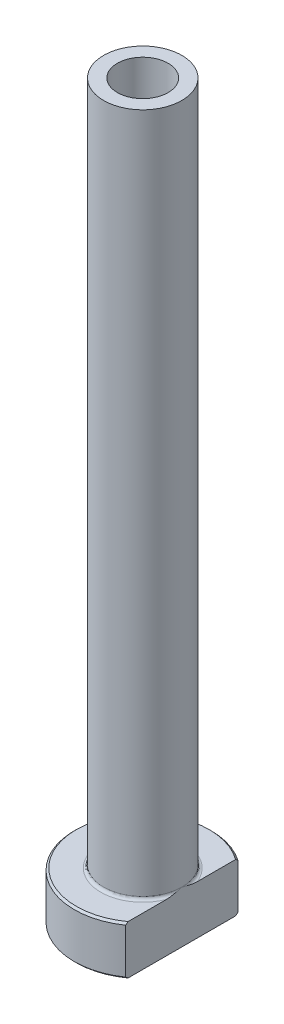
ISO-10303-21;
HEADER;
FILE_DESCRIPTION(('STEP AP214'),'2;1');
FILE_NAME('part.step','',(''),(''),'','','');
FILE_SCHEMA(('AUTOMOTIVE_DESIGN { 1 0 10303 214 1 1 1 1 }'));
ENDSEC;
DATA;
#1=APPLICATION_CONTEXT('core data for automotive mechanical design processes');
#2=APPLICATION_PROTOCOL_DEFINITION('international standard','automotive_design',2000,#1);
#3=PRODUCT_CONTEXT('',#1,'mechanical');
#4=PRODUCT('Part','Part','',(#3));
#5=PRODUCT_RELATED_PRODUCT_CATEGORY('part','',(#4));
#6=PRODUCT_DEFINITION_FORMATION('','',#4);
#7=PRODUCT_DEFINITION_CONTEXT('part definition',#1,'design');
#8=PRODUCT_DEFINITION('design','',#6,#7);
#9=PRODUCT_DEFINITION_SHAPE('','',#8);
#10=(LENGTH_UNIT() NAMED_UNIT(*) SI_UNIT(.MILLI.,.METRE.));
#11=(NAMED_UNIT(*) PLANE_ANGLE_UNIT() SI_UNIT($,.RADIAN.));
#12=(NAMED_UNIT(*) SI_UNIT($,.STERADIAN.) SOLID_ANGLE_UNIT());
#13=UNCERTAINTY_MEASURE_WITH_UNIT(LENGTH_MEASURE(1.E-05),#10,'distance_accuracy_value','');
#14=(GEOMETRIC_REPRESENTATION_CONTEXT(3) GLOBAL_UNCERTAINTY_ASSIGNED_CONTEXT((#13)) GLOBAL_UNIT_ASSIGNED_CONTEXT((#10,
#11,#12)) REPRESENTATION_CONTEXT('',''));
#15=CARTESIAN_POINT('',(0.,0.,0.));
#16=DIRECTION('',(0.,0.,1.));
#17=DIRECTION('',(1.,0.,0.));
#18=AXIS2_PLACEMENT_3D('',#15,#16,#17);
#19=CARTESIAN_POINT('',(0.,92.1876809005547,0.));
#20=DIRECTION('',(0.,1.,0.));
#21=DIRECTION('',(0.,0.,1.));
#22=AXIS2_PLACEMENT_3D('',#19,#20,#21);
#23=CYLINDRICAL_SURFACE('',#22,2.60000000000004);
#24=CARTESIAN_POINT('',(0.,75.,0.));
#25=DIRECTION('',(0.,1.,0.));
#26=DIRECTION('',(0.,0.,1.));
#27=AXIS2_PLACEMENT_3D('',#24,#25,#26);
#28=CIRCLE('',#27,2.60000000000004);
#29=CARTESIAN_POINT('',(0.,75.,2.60000000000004));
#30=VERTEX_POINT('',#29);
#31=EDGE_CURVE('E167',#30,#30,#28,.T.);
#32=ORIENTED_EDGE('',*,*,#31,.T.);
#33=EDGE_LOOP('',(#32));
#34=FACE_BOUND('',#33,.T.);
#35=CARTESIAN_POINT('',(0.,30.,0.));
#36=DIRECTION('',(0.,1.,0.));
#37=DIRECTION('',(0.,0.,1.));
#38=AXIS2_PLACEMENT_3D('',#35,#36,#37);
#39=CIRCLE('',#38,2.60000000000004);
#40=CARTESIAN_POINT('',(0.,30.,2.60000000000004));
#41=VERTEX_POINT('',#40);
#42=EDGE_CURVE('E170',#41,#41,#39,.T.);
#43=ORIENTED_EDGE('',*,*,#42,.F.);
#44=EDGE_LOOP('',(#43));
#45=FACE_BOUND('',#44,.T.);
#46=ADVANCED_FACE('F32',(#34,#45),#23,.F.);
#47=CARTESIAN_POINT('',(-2.60000000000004,75.,0.));
#48=DIRECTION('',(0.,1.,0.));
#49=DIRECTION('',(0.,0.,1.));
#50=AXIS2_PLACEMENT_3D('',#47,#48,#49);
#51=PLANE('',#50);
#52=CARTESIAN_POINT('',(0.,75.,0.));
#53=DIRECTION('',(0.,1.,0.));
#54=DIRECTION('',(0.,0.,1.));
#55=AXIS2_PLACEMENT_3D('',#52,#53,#54);
#56=CIRCLE('',#55,4.);
#57=CARTESIAN_POINT('',(0.,75.,4.));
#58=VERTEX_POINT('',#57);
#59=EDGE_CURVE('E174',#58,#58,#56,.T.);
#60=ORIENTED_EDGE('',*,*,#59,.T.);
#61=EDGE_LOOP('',(#60));
#62=FACE_BOUND('',#61,.T.);
#63=ORIENTED_EDGE('',*,*,#31,.F.);
#64=EDGE_LOOP('',(#63));
#65=FACE_BOUND('',#64,.T.);
#66=ADVANCED_FACE('F157',(#62,#65),#51,.T.);
#67=CARTESIAN_POINT('',(0.,92.1876809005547,0.));
#68=DIRECTION('',(0.,1.,0.));
#69=DIRECTION('',(0.,0.,1.));
#70=AXIS2_PLACEMENT_3D('',#67,#68,#69);
#71=CYLINDRICAL_SURFACE('',#70,3.99999999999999);
#72=CARTESIAN_POINT('',(0.,5.3,0.));
#73=DIRECTION('',(0.,1.,0.));
#74=DIRECTION('',(0.,0.,1.));
#75=AXIS2_PLACEMENT_3D('',#72,#73,#74);
#76=CIRCLE('',#75,3.99999999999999);
#77=CARTESIAN_POINT('',(3.99999999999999,5.3,0.));
#78=VERTEX_POINT('',#77);
#79=EDGE_CURVE('E180',#78,#78,#76,.T.);
#80=ORIENTED_EDGE('',*,*,#79,.T.);
#81=EDGE_LOOP('',(#80));
#82=FACE_BOUND('',#81,.T.);
#83=ORIENTED_EDGE('',*,*,#59,.F.);
#84=EDGE_LOOP('',(#83));
#85=FACE_BOUND('',#84,.T.);
#86=ADVANCED_FACE('F162',(#82,#85),#71,.T.);
#87=CARTESIAN_POINT('',(-3.99999999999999,5.,0.));
#88=DIRECTION('',(0.,1.,0.));
#89=DIRECTION('',(0.,0.,1.));
#90=AXIS2_PLACEMENT_3D('',#87,#88,#89);
#91=PLANE('',#90);
#92=DIRECTION('',(0.,0.,1.));
#93=VECTOR('',#92,1.);
#94=CARTESIAN_POINT('',(4.,5.,0.));
#95=LINE('',#94,#93);
#96=CARTESIAN_POINT('',(4.,5.,-5.49909083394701));
#97=VERTEX_POINT('',#96);
#98=CARTESIAN_POINT('',(4.,5.,-1.57797338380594));
#99=VERTEX_POINT('',#98);
#100=EDGE_CURVE('E54',#97,#99,#95,.T.);
#101=ORIENTED_EDGE('',*,*,#100,.F.);
#102=CARTESIAN_POINT('',(0.,5.,0.));
#103=DIRECTION('',(0.,1.,0.));
#104=DIRECTION('',(0.,0.,1.));
#105=AXIS2_PLACEMENT_3D('',#102,#103,#104);
#106=CIRCLE('',#105,6.8);
#107=CARTESIAN_POINT('',(3.99999999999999,5.,5.49909083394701));
#108=VERTEX_POINT('',#107);
#109=EDGE_CURVE('E186',#97,#108,#106,.T.);
#110=ORIENTED_EDGE('',*,*,#109,.T.);
#111=CARTESIAN_POINT('',(4.,5.,1.57797338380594));
#112=VERTEX_POINT('',#111);
#113=EDGE_CURVE('E134',#112,#108,#95,.T.);
#114=ORIENTED_EDGE('',*,*,#113,.F.);
#115=CARTESIAN_POINT('',(0.,5.,0.));
#116=DIRECTION('',(0.,1.,0.));
#117=DIRECTION('',(0.,0.,1.));
#118=AXIS2_PLACEMENT_3D('',#115,#116,#117);
#119=CIRCLE('',#118,4.29999999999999);
#120=EDGE_CURVE('E183',#112,#99,#119,.F.);
#121=ORIENTED_EDGE('',*,*,#120,.T.);
#122=EDGE_LOOP('',(#101,#110,#114,#121));
#123=FACE_BOUND('',#122,.T.);
#124=ADVANCED_FACE('F197',(#123),#91,.T.);
#125=CARTESIAN_POINT('',(0.,92.1876809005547,0.));
#126=DIRECTION('',(0.,1.,0.));
#127=DIRECTION('',(0.,0.,1.));
#128=AXIS2_PLACEMENT_3D('',#125,#126,#127);
#129=CYLINDRICAL_SURFACE('',#128,6.99999999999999);
#130=DIRECTION('',(0.,-1.,0.));
#131=VECTOR('',#130,1.);
#132=CARTESIAN_POINT('',(3.99999999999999,75.,5.74456264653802));
#133=LINE('',#132,#131);
#134=CARTESIAN_POINT('',(3.99999999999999,4.8,5.74456264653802));
#135=VERTEX_POINT('',#134);
#136=CARTESIAN_POINT('',(3.99999999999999,0.199999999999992,5.74456264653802));
#137=VERTEX_POINT('',#136);
#138=EDGE_CURVE('E82',#135,#137,#133,.T.);
#139=ORIENTED_EDGE('',*,*,#138,.F.);
#140=CARTESIAN_POINT('',(0.,4.8,0.));
#141=DIRECTION('',(0.,1.,0.));
#142=DIRECTION('',(0.,0.,1.));
#143=AXIS2_PLACEMENT_3D('',#140,#141,#142);
#144=CIRCLE('',#143,6.99999999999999);
#145=CARTESIAN_POINT('',(4.,4.8,-5.74456264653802));
#146=VERTEX_POINT('',#145);
#147=EDGE_CURVE('E95',#135,#146,#144,.F.);
#148=ORIENTED_EDGE('',*,*,#147,.T.);
#149=DIRECTION('',(0.,-1.,0.));
#150=VECTOR('',#149,1.);
#151=CARTESIAN_POINT('',(4.,75.,-5.74456264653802));
#152=LINE('',#151,#150);
#153=CARTESIAN_POINT('',(4.,0.199999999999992,-5.74456264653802));
#154=VERTEX_POINT('',#153);
#155=EDGE_CURVE('E192',#146,#154,#152,.T.);
#156=ORIENTED_EDGE('',*,*,#155,.T.);
#157=CARTESIAN_POINT('',(0.,0.199999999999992,0.));
#158=DIRECTION('',(0.,-1.,0.));
#159=DIRECTION('',(0.,0.,-1.));
#160=AXIS2_PLACEMENT_3D('',#157,#158,#159);
#161=CIRCLE('',#160,6.99999999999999);
#162=EDGE_CURVE('E98',#154,#137,#161,.F.);
#163=ORIENTED_EDGE('',*,*,#162,.T.);
#164=EDGE_LOOP('',(#139,#148,#156,#163));
#165=FACE_BOUND('',#164,.T.);
#166=ADVANCED_FACE('F190',(#165),#129,.T.);
#167=CARTESIAN_POINT('',(-6.99999999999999,0.,0.));
#168=DIRECTION('',(0.,-1.,0.));
#169=DIRECTION('',(0.,0.,-1.));
#170=AXIS2_PLACEMENT_3D('',#167,#168,#169);
#171=PLANE('',#170);
#172=CARTESIAN_POINT('',(0.,0.,0.));
#173=DIRECTION('',(0.,-1.,0.));
#174=DIRECTION('',(0.,0.,-1.));
#175=AXIS2_PLACEMENT_3D('',#172,#173,#174);
#176=CIRCLE('',#175,3.34999999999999);
#177=CARTESIAN_POINT('',(0.,0.,-3.34999999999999));
#178=VERTEX_POINT('',#177);
#179=EDGE_CURVE('E40',#178,#178,#176,.F.);
#180=ORIENTED_EDGE('',*,*,#179,.T.);
#181=EDGE_LOOP('',(#180));
#182=FACE_BOUND('',#181,.T.);
#183=DIRECTION('',(0.,0.,-1.));
#184=VECTOR('',#183,1.);
#185=CARTESIAN_POINT('',(3.99999999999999,0.,5.74456264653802));
#186=LINE('',#185,#184);
#187=CARTESIAN_POINT('',(3.99999999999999,0.,5.49909083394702));
#188=VERTEX_POINT('',#187);
#189=CARTESIAN_POINT('',(4.,0.,-5.49909083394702));
#190=VERTEX_POINT('',#189);
#191=EDGE_CURVE('E47',#188,#190,#186,.T.);
#192=ORIENTED_EDGE('',*,*,#191,.F.);
#193=CARTESIAN_POINT('',(0.,0.,0.));
#194=DIRECTION('',(0.,-1.,0.));
#195=DIRECTION('',(0.,0.,-1.));
#196=AXIS2_PLACEMENT_3D('',#193,#194,#195);
#197=CIRCLE('',#196,6.80000000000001);
#198=EDGE_CURVE('E92',#188,#190,#197,.T.);
#199=ORIENTED_EDGE('',*,*,#198,.T.);
#200=EDGE_LOOP('',(#192,#199));
#201=FACE_BOUND('',#200,.T.);
#202=ADVANCED_FACE('F91',(#182,#201),#171,.T.);
#203=CARTESIAN_POINT('',(0.,92.1876809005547,0.));
#204=DIRECTION('',(0.,1.,0.));
#205=DIRECTION('',(0.,0.,1.));
#206=AXIS2_PLACEMENT_3D('',#203,#204,#205);
#207=CYLINDRICAL_SURFACE('',#206,2.84999999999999);
#208=CARTESIAN_POINT('',(0.,0.5,0.));
#209=DIRECTION('',(0.,-1.,0.));
#210=DIRECTION('',(0.,0.,-1.));
#211=AXIS2_PLACEMENT_3D('',#208,#209,#210);
#212=CIRCLE('',#211,2.84999999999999);
#213=CARTESIAN_POINT('',(0.,0.5,-2.84999999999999));
#214=VERTEX_POINT('',#213);
#215=EDGE_CURVE('E11',#214,#214,#212,.T.);
#216=ORIENTED_EDGE('',*,*,#215,.T.);
#217=EDGE_LOOP('',(#216));
#218=FACE_BOUND('',#217,.T.);
#219=CARTESIAN_POINT('',(0.,18.,0.));
#220=DIRECTION('',(0.,1.,0.));
#221=DIRECTION('',(0.,0.,1.));
#222=AXIS2_PLACEMENT_3D('',#219,#220,#221);
#223=CIRCLE('',#222,2.84999999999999);
#224=CARTESIAN_POINT('',(0.,18.,2.84999999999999));
#225=VERTEX_POINT('',#224);
#226=EDGE_CURVE('E172',#225,#225,#223,.T.);
#227=ORIENTED_EDGE('',*,*,#226,.T.);
#228=EDGE_LOOP('',(#227));
#229=FACE_BOUND('',#228,.T.);
#230=ADVANCED_FACE('F215',(#218,#229),#207,.F.);
#231=CARTESIAN_POINT('',(0.,18.,0.));
#232=DIRECTION('',(0.,-1.,0.));
#233=DIRECTION('',(0.,0.,-1.));
#234=AXIS2_PLACEMENT_3D('',#231,#232,#233);
#235=CONICAL_SURFACE('',#234,2.84999999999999,0.0208303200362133);
#236=ORIENTED_EDGE('',*,*,#42,.T.);
#237=EDGE_LOOP('',(#236));
#238=FACE_BOUND('',#237,.T.);
#239=ORIENTED_EDGE('',*,*,#226,.F.);
#240=EDGE_LOOP('',(#239));
#241=FACE_BOUND('',#240,.T.);
#242=ADVANCED_FACE('F111',(#238,#241),#235,.F.);
#243=CARTESIAN_POINT('',(0.,5.3,0.));
#244=DIRECTION('',(0.,1.,0.));
#245=DIRECTION('',(0.,0.,1.));
#246=AXIS2_PLACEMENT_3D('',#243,#244,#245);
#247=TOROIDAL_SURFACE('',#246,4.29999999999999,0.3);
#248=ORIENTED_EDGE('',*,*,#120,.F.);
#249=CARTESIAN_POINT('',(3.99999999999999,5.3,0.));
#250=CARTESIAN_POINT('',(3.99999999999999,5.30000062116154,-1.06250692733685E-10));
#251=CARTESIAN_POINT('',(3.99999999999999,5.30000124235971,2.17725991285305E-07));
#252=CARTESIAN_POINT('',(3.99999999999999,5.30000240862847,8.36140834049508E-07));
#253=CARTESIAN_POINT('',(3.99999999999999,5.30000294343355,1.2501166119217E-06));
#254=CARTESIAN_POINT('',(3.99999999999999,5.3000040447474,2.23959309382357E-06));
#255=CARTESIAN_POINT('',(3.99999999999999,5.30000459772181,2.83084427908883E-06));
#256=CARTESIAN_POINT('',(3.99999999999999,5.30000559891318,4.06516564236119E-06));
#257=CARTESIAN_POINT('',(3.99999999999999,5.30000604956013,4.70640046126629E-06));
#258=CARTESIAN_POINT('',(3.99999999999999,5.30000769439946,7.15677144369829E-06));
#259=CARTESIAN_POINT('',(3.99999999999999,5.3000087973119,9.02995892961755E-06));
#260=CARTESIAN_POINT('',(3.99999999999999,5.30001063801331,1.27664878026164E-05));
#261=CARTESIAN_POINT('',(3.99999999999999,5.30001139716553,1.46197798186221E-05));
#262=CARTESIAN_POINT('',(3.99999999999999,5.3000145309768,2.23679207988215E-05));
#263=CARTESIAN_POINT('',(3.99999999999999,5.30001683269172,2.82968730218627E-05));
#264=CARTESIAN_POINT('',(3.99999999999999,5.30002027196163,3.95668707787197E-05));
#265=CARTESIAN_POINT('',(3.99999999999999,5.30002152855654,4.48715441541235E-05));
#266=CARTESIAN_POINT('',(3.99999999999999,5.30003060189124,8.40118167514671E-05));
#267=CARTESIAN_POINT('',(4.,5.30003739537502,0.000118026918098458));
#268=CARTESIAN_POINT('',(4.,5.30006713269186,0.000252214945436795));
#269=CARTESIAN_POINT('',(4.,5.30009559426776,0.000351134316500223));
#270=CARTESIAN_POINT('',(3.99999999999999,5.30020622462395,0.000742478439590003));
#271=CARTESIAN_POINT('',(3.99999999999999,5.30028475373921,0.00103561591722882));
#272=CARTESIAN_POINT('',(4.,5.3005988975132,0.0021992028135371));
#273=CARTESIAN_POINT('',(4.,5.30083905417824,0.0030687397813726));
#274=CARTESIAN_POINT('',(3.99999999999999,5.30183682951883,0.00669141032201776));
#275=CARTESIAN_POINT('',(3.99999999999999,5.30258877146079,0.00944568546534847));
#276=CARTESIAN_POINT('',(4.,5.31066890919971,0.0390293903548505));
#277=CARTESIAN_POINT('',(4.,5.31802631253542,0.0658531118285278));
#278=CARTESIAN_POINT('',(3.99999999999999,5.33239676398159,0.118441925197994));
#279=CARTESIAN_POINT('',(3.99999999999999,5.33941183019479,0.14420651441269));
#280=CARTESIAN_POINT('',(4.,5.35427366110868,0.199017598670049));
#281=CARTESIAN_POINT('',(4.,5.36211313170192,0.228066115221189));
#282=CARTESIAN_POINT('',(4.,5.37776349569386,0.28651184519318));
#283=CARTESIAN_POINT('',(4.,5.38557313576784,0.315909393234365));
#284=CARTESIAN_POINT('',(4.,5.40425662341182,0.386994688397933));
#285=CARTESIAN_POINT('',(4.,5.41505237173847,0.428703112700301));
#286=CARTESIAN_POINT('',(4.,5.43592310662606,0.511098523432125));
#287=CARTESIAN_POINT('',(4.,5.44600969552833,0.551782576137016));
#288=CARTESIAN_POINT('',(4.,5.47850986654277,0.686599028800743));
#289=CARTESIAN_POINT('',(4.,5.49978370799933,0.781011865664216));
#290=CARTESIAN_POINT('',(4.,5.53807543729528,0.971847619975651));
#291=CARTESIAN_POINT('',(4.,5.55504273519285,1.06828120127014));
#292=CARTESIAN_POINT('',(4.,5.57582405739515,1.21752725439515));
#293=CARTESIAN_POINT('',(4.,5.58209796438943,1.26999379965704));
#294=CARTESIAN_POINT('',(4.,5.59210686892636,1.37516324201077));
#295=CARTESIAN_POINT('',(4.,5.59584265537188,1.42786606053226));
#296=CARTESIAN_POINT('',(4.,5.60010438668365,1.53310673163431));
#297=CARTESIAN_POINT('',(4.,5.6006487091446,1.58564378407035));
#298=CARTESIAN_POINT('',(4.,5.59767158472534,1.69058605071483));
#299=CARTESIAN_POINT('',(4.,5.59415502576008,1.74299134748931));
#300=CARTESIAN_POINT('',(4.,5.58503062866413,1.8190329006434));
#301=CARTESIAN_POINT('',(4.,5.58157617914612,1.84292934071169));
#302=CARTESIAN_POINT('',(4.,5.5732995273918,1.89051061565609));
#303=CARTESIAN_POINT('',(4.,5.56847619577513,1.91419525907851));
#304=CARTESIAN_POINT('',(4.,5.55726644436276,1.96092888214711));
#305=CARTESIAN_POINT('',(4.,5.55089740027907,1.98398195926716));
#306=CARTESIAN_POINT('',(4.,5.53623434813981,2.0294555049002));
#307=CARTESIAN_POINT('',(4.,5.52794253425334,2.05187666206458));
#308=CARTESIAN_POINT('',(4.,5.50887098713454,2.09590631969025));
#309=CARTESIAN_POINT('',(4.,5.49806837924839,2.1175050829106));
#310=CARTESIAN_POINT('',(4.,5.47333401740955,2.15885583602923));
#311=CARTESIAN_POINT('',(4.,5.45941272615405,2.17861369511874));
#312=CARTESIAN_POINT('',(4.,5.43588221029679,2.20522942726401));
#313=CARTESIAN_POINT('',(4.,5.42781139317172,2.21344043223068));
#314=CARTESIAN_POINT('',(4.,5.41065114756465,2.22875149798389));
#315=CARTESIAN_POINT('',(4.,5.40156129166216,2.23585108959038));
#316=CARTESIAN_POINT('',(4.,5.38220524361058,2.24859694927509));
#317=CARTESIAN_POINT('',(4.,5.37192420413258,2.25422119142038));
#318=CARTESIAN_POINT('',(4.,5.35045072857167,2.26331064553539));
#319=CARTESIAN_POINT('',(4.,5.33926122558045,2.26678251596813));
#320=CARTESIAN_POINT('',(4.,5.31952044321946,2.27051268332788));
#321=CARTESIAN_POINT('',(4.,5.31108453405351,2.27139016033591));
#322=CARTESIAN_POINT('',(4.,5.29418624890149,2.2716896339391));
#323=CARTESIAN_POINT('',(4.,5.28572387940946,2.27111196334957));
#324=CARTESIAN_POINT('',(4.,5.26904138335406,2.26855580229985));
#325=CARTESIAN_POINT('',(4.,5.26082066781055,2.26658107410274));
#326=CARTESIAN_POINT('',(4.,5.24478214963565,2.26139496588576));
#327=CARTESIAN_POINT('',(4.,5.23696461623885,2.25818277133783));
#328=CARTESIAN_POINT('',(4.,5.21851235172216,2.24908332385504));
#329=CARTESIAN_POINT('',(4.,5.20815219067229,2.24264095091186));
#330=CARTESIAN_POINT('',(4.,5.18857975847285,2.22819957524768));
#331=CARTESIAN_POINT('',(4.,5.17937061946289,2.22019647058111));
#332=CARTESIAN_POINT('',(4.,5.15665383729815,2.19777756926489));
#333=CARTESIAN_POINT('',(4.,5.14403484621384,2.18246908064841));
#334=CARTESIAN_POINT('',(4.,5.12118369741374,2.15020843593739));
#335=CARTESIAN_POINT('',(4.,5.11095480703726,2.13325407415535));
#336=CARTESIAN_POINT('',(4.,5.09273574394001,2.09892324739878));
#337=CARTESIAN_POINT('',(4.,5.08468212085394,2.08157988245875));
#338=CARTESIAN_POINT('',(4.,5.07005901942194,2.04627072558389));
#339=CARTESIAN_POINT('',(4.,5.06349101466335,2.02830433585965));
#340=CARTESIAN_POINT('',(4.,5.04555485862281,1.97350761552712));
#341=CARTESIAN_POINT('',(4.,5.03608974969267,1.93605770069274));
#342=CARTESIAN_POINT('',(4.,5.0178056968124,1.8452923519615));
#343=CARTESIAN_POINT('',(4.,5.01077018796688,1.79164082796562));
#344=CARTESIAN_POINT('',(4.,5.00182846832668,1.6837994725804));
#345=CARTESIAN_POINT('',(4.,4.99993887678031,1.62960846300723));
#346=CARTESIAN_POINT('',(4.,5.00006129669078,1.52361204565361));
#347=CARTESIAN_POINT('',(4.,5.00190698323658,1.4718055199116));
#348=CARTESIAN_POINT('',(4.,5.00841243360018,1.36835357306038));
#349=CARTESIAN_POINT('',(4.,5.01307376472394,1.31670825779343));
#350=CARTESIAN_POINT('',(4.,5.02905484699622,1.17431887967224));
#351=CARTESIAN_POINT('',(4.,5.04274090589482,1.08384207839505));
#352=CARTESIAN_POINT('',(4.,5.06701714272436,0.947757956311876));
#353=CARTESIAN_POINT('',(4.,5.07585573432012,0.901814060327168));
#354=CARTESIAN_POINT('',(4.,5.09458665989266,0.810008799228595));
#355=CARTESIAN_POINT('',(4.,5.10448180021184,0.764148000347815));
#356=CARTESIAN_POINT('',(4.,5.1289243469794,0.655631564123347));
#357=CARTESIAN_POINT('',(4.,5.14383556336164,0.593058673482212));
#358=CARTESIAN_POINT('',(4.,5.17458762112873,0.468885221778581));
#359=CARTESIAN_POINT('',(4.,5.19041623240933,0.407281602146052));
#360=CARTESIAN_POINT('',(3.99999999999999,5.22090834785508,0.291232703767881));
#361=CARTESIAN_POINT('',(3.99999999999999,5.23550024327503,0.236768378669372));
#362=CARTESIAN_POINT('',(4.,5.26562550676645,0.125604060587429));
#363=CARTESIAN_POINT('',(4.00000000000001,5.28117250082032,0.0689076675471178));
#364=CARTESIAN_POINT('',(3.99999999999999,5.29741226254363,0.00944154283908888));
#365=CARTESIAN_POINT('',(3.99999999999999,5.29816540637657,0.00668315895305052));
#366=CARTESIAN_POINT('',(4.,5.29916346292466,0.00305954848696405));
#367=CARTESIAN_POINT('',(4.,5.29940273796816,0.00219318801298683));
#368=CARTESIAN_POINT('',(3.99999999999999,5.29971580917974,0.00103357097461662));
#369=CARTESIAN_POINT('',(3.99999999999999,5.29979412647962,0.000741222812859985));
#370=CARTESIAN_POINT('',(4.,5.29990450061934,0.00035080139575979));
#371=CARTESIAN_POINT('',(4.,5.29993292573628,0.00025201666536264));
#372=CARTESIAN_POINT('',(4.,5.2999626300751,0.000117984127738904));
#373=CARTESIAN_POINT('',(3.99999999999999,5.29996941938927,8.39881851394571E-05));
#374=CARTESIAN_POINT('',(3.99999999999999,5.29997848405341,4.48673984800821E-05));
#375=CARTESIAN_POINT('',(3.99999999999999,5.29997973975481,3.95638156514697E-05));
#376=CARTESIAN_POINT('',(3.99999999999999,5.29998317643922,2.82960308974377E-05));
#377=CARTESIAN_POINT('',(3.99999999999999,5.29998547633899,2.236814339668E-05));
#378=CARTESIAN_POINT('',(3.99999999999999,5.29998860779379,1.46210987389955E-05));
#379=CARTESIAN_POINT('',(3.99999999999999,5.29998936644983,1.27678884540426E-05));
#380=CARTESIAN_POINT('',(3.99999999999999,5.29999120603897,9.03143915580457E-06));
#381=CARTESIAN_POINT('',(3.99999999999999,5.29999230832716,7.1582397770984E-06));
#382=CARTESIAN_POINT('',(3.99999999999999,5.29999395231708,4.70775453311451E-06));
#383=CARTESIAN_POINT('',(3.99999999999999,5.29999440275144,4.06646315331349E-06));
#384=CARTESIAN_POINT('',(3.99999999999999,5.2999954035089,2.83199030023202E-06));
#385=CARTESIAN_POINT('',(3.99999999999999,5.29999595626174,2.24064296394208E-06));
#386=CARTESIAN_POINT('',(3.99999999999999,5.29999705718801,1.25093940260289E-06));
#387=CARTESIAN_POINT('',(3.99999999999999,5.29999759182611,8.36840805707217E-07));
#388=CARTESIAN_POINT('',(3.99999999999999,5.29999875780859,2.18117629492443E-07));
#389=CARTESIAN_POINT('',(3.99999999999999,5.29999937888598,1.06243770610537E-10));
#390=CARTESIAN_POINT('',(3.99999999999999,5.3,0.));
#391=B_SPLINE_CURVE_WITH_KNOTS('',3,(#249,#250,#251,#252,#253,#254,#255,#256,#257,#258,#259,
#260,#261,#262,#263,#264,#265,#266,#267,#268,#269,#270,#271,#272,#273,#274,#275,#276,#277,#278,
#279,#280,#281,#282,#283,#284,#285,#286,#287,#288,#289,#290,#291,#292,#293,#294,#295,#296,#297,
#298,#299,#300,#301,#302,#303,#304,#305,#306,#307,#308,#309,#310,#311,#312,#313,#314,#315,#316,
#317,#318,#319,#320,#321,#322,#323,#324,#325,#326,#327,#328,#329,#330,#331,#332,#333,#334,#335,
#336,#337,#338,#339,#340,#341,#342,#343,#344,#345,#346,#347,#348,#349,#350,#351,#352,#353,#354,
#355,#356,#357,#358,#359,#360,#361,#362,#363,#364,#365,#366,#367,#368,#369,#370,#371,#372,#373,
#374,#375,#376,#377,#378,#379,#380,#381,#382,#383,#384,#385,#386,#387,#388,#389,#390),
.UNSPECIFIED.,.T.,.F.,(4,2,2,2,2,2,2,2,2,2,2,2,2,2,2,2,2,2,2,2,2,2,2,2,2,2,2,2,2,2,2,2,2,2,2,2,
2,2,2,2,2,2,2,2,2,2,2,2,2,2,2,2,2,2,2,2,2,2,2,2,2,2,2,2,2,2,2,2,2,2,4),(0.,1.87484564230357E-06,
3.9018029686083E-06,6.31684198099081E-06,8.66652435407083E-06,1.51627608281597E-05,
2.11658001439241E-05,4.02090842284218E-05,5.65429557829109E-05,0.000160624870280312,
0.000469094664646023,0.00137985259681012,0.00408571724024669,0.0126514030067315,
0.0960918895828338,0.176200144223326,0.266463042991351,0.357714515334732,0.48696124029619,
0.612707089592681,0.902988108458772,1.19653589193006,1.35501075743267,1.51343634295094,
1.6709487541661,1.82827177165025,1.90067591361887,1.97313996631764,2.04482437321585,
2.11642737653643,2.188710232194,2.2607541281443,2.29521947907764,2.32969934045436,
2.36466792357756,2.39952778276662,2.42485422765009,2.45017488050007,2.47542760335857,
2.50069697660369,2.53708899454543,2.57357798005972,2.63276032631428,2.69202310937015,
2.74930315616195,2.80663977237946,2.92223125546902,3.08420752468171,3.24670629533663,
3.40212850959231,3.55763731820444,3.83192962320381,3.9722838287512,4.11302057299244,
4.3059813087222,4.49678885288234,4.66594443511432,4.84230602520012,4.85088453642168,
4.85358051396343,4.8544888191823,4.85479687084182,4.85490089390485,4.85491722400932,
4.85493626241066,4.85494226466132,4.85494875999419,4.85495110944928,4.85495352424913,
4.85495555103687,4.85495742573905),.UNSPECIFIED.);
#392=EDGE_CURVE('E126',#112,#78,#391,.T.);
#393=ORIENTED_EDGE('',*,*,#392,.T.);
#394=ORIENTED_EDGE('',*,*,#79,.F.);
#395=CARTESIAN_POINT('',(3.99999999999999,5.3,0.));
#396=CARTESIAN_POINT('',(3.99999999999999,5.29999937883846,1.0625180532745E-10));
#397=CARTESIAN_POINT('',(3.99999999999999,5.29999875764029,-2.17725990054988E-07));
#398=CARTESIAN_POINT('',(3.99999999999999,5.29999759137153,-8.36140832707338E-07));
#399=CARTESIAN_POINT('',(3.99999999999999,5.29999705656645,-1.25011661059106E-06));
#400=CARTESIAN_POINT('',(3.99999999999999,5.2999959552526,-2.23959309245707E-06));
#401=CARTESIAN_POINT('',(3.99999999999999,5.29999540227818,-2.83084427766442E-06));
#402=CARTESIAN_POINT('',(3.99999999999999,5.29999440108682,-4.06516564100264E-06));
#403=CARTESIAN_POINT('',(3.99999999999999,5.29999395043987,-4.70640046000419E-06));
#404=CARTESIAN_POINT('',(3.99999999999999,5.29999230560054,-7.15677144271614E-06));
#405=CARTESIAN_POINT('',(3.99999999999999,5.2999912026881,-9.02995892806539E-06));
#406=CARTESIAN_POINT('',(3.99999999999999,5.29998936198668,-1.27664878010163E-05));
#407=CARTESIAN_POINT('',(3.99999999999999,5.29998860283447,-1.46197798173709E-05));
#408=CARTESIAN_POINT('',(3.99999999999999,5.2999854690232,-2.23679207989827E-05));
#409=CARTESIAN_POINT('',(3.99999999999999,5.29998316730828,-2.82968730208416E-05));
#410=CARTESIAN_POINT('',(3.99999999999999,5.29997972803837,-3.95668707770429E-05));
#411=CARTESIAN_POINT('',(3.99999999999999,5.29997847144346,-4.48715441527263E-05));
#412=CARTESIAN_POINT('',(3.99999999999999,5.29996939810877,-8.40118167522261E-05));
#413=CARTESIAN_POINT('',(4.,5.29996260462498,-0.000118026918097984));
#414=CARTESIAN_POINT('',(4.,5.29993286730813,-0.000252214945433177));
#415=CARTESIAN_POINT('',(4.,5.29990440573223,-0.000351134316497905));
#416=CARTESIAN_POINT('',(3.99999999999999,5.29979377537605,-0.000742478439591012));
#417=CARTESIAN_POINT('',(3.99999999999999,5.29971524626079,-0.00103561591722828));
#418=CARTESIAN_POINT('',(4.,5.29940110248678,-0.00219920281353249));
#419=CARTESIAN_POINT('',(4.,5.29916094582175,-0.00306873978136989));
#420=CARTESIAN_POINT('',(3.99999999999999,5.29816317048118,-0.00669141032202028));
#421=CARTESIAN_POINT('',(3.99999999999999,5.29741122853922,-0.00944568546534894));
#422=CARTESIAN_POINT('',(4.,5.28933109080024,-0.0390293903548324));
#423=CARTESIAN_POINT('',(4.,5.28197368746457,-0.0658531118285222));
#424=CARTESIAN_POINT('',(3.99999999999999,5.26760323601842,-0.118441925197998));
#425=CARTESIAN_POINT('',(3.99999999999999,5.26058816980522,-0.144206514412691));
#426=CARTESIAN_POINT('',(4.,5.24572633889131,-0.199017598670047));
#427=CARTESIAN_POINT('',(4.,5.23788686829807,-0.228066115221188));
#428=CARTESIAN_POINT('',(4.,5.22223650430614,-0.28651184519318));
#429=CARTESIAN_POINT('',(4.,5.21442686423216,-0.315909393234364));
#430=CARTESIAN_POINT('',(4.,5.19574337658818,-0.386994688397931));
#431=CARTESIAN_POINT('',(4.,5.18494762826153,-0.428703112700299));
#432=CARTESIAN_POINT('',(4.,5.16407689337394,-0.511098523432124));
#433=CARTESIAN_POINT('',(4.,5.15399030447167,-0.551782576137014));
#434=CARTESIAN_POINT('',(4.,5.12149013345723,-0.68659902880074));
#435=CARTESIAN_POINT('',(4.,5.10021629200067,-0.781011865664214));
#436=CARTESIAN_POINT('',(4.,5.06192456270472,-0.97184761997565));
#437=CARTESIAN_POINT('',(4.,5.04495726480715,-1.06828120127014));
#438=CARTESIAN_POINT('',(4.,5.02417594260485,-1.21752725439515));
#439=CARTESIAN_POINT('',(4.,5.01790203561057,-1.26999379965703));
#440=CARTESIAN_POINT('',(4.,5.00789313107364,-1.37516324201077));
#441=CARTESIAN_POINT('',(4.,5.00415734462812,-1.42786606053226));
#442=CARTESIAN_POINT('',(4.,4.99989561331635,-1.5331067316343));
#443=CARTESIAN_POINT('',(4.,4.9993512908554,-1.58564378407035));
#444=CARTESIAN_POINT('',(4.,5.00232841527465,-1.69058605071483));
#445=CARTESIAN_POINT('',(4.,5.00584497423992,-1.74299134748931));
#446=CARTESIAN_POINT('',(4.,5.01496937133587,-1.8190329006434));
#447=CARTESIAN_POINT('',(4.,5.01842382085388,-1.84292934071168));
#448=CARTESIAN_POINT('',(4.,5.0267004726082,-1.89051061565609));
#449=CARTESIAN_POINT('',(4.,5.03152380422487,-1.9141952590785));
#450=CARTESIAN_POINT('',(4.,5.04273355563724,-1.96092888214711));
#451=CARTESIAN_POINT('',(4.,5.04910259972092,-1.98398195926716));
#452=CARTESIAN_POINT('',(4.,5.06376565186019,-2.0294555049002));
#453=CARTESIAN_POINT('',(4.,5.07205746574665,-2.05187666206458));
#454=CARTESIAN_POINT('',(4.,5.09112901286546,-2.09590631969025));
#455=CARTESIAN_POINT('',(4.,5.10193162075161,-2.1175050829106));
#456=CARTESIAN_POINT('',(4.,5.12666598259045,-2.15885583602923));
#457=CARTESIAN_POINT('',(4.,5.14058727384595,-2.17861369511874));
#458=CARTESIAN_POINT('',(4.,5.16411778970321,-2.20522942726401));
#459=CARTESIAN_POINT('',(4.,5.17218860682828,-2.21344043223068));
#460=CARTESIAN_POINT('',(4.,5.18934885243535,-2.22875149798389));
#461=CARTESIAN_POINT('',(4.,5.19843870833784,-2.23585108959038));
#462=CARTESIAN_POINT('',(4.,5.21779475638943,-2.24859694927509));
#463=CARTESIAN_POINT('',(4.,5.22807579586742,-2.25422119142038));
#464=CARTESIAN_POINT('',(4.,5.24954927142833,-2.26331064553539));
#465=CARTESIAN_POINT('',(4.,5.26073877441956,-2.26678251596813));
#466=CARTESIAN_POINT('',(4.,5.28047955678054,-2.27051268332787));
#467=CARTESIAN_POINT('',(4.,5.28891546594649,-2.27139016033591));
#468=CARTESIAN_POINT('',(4.,5.30581375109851,-2.2716896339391));
#469=CARTESIAN_POINT('',(4.,5.31427612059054,-2.27111196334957));
#470=CARTESIAN_POINT('',(4.,5.33095861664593,-2.26855580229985));
#471=CARTESIAN_POINT('',(4.,5.33917933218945,-2.26658107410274));
#472=CARTESIAN_POINT('',(4.,5.35521785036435,-2.26139496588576));
#473=CARTESIAN_POINT('',(4.,5.36303538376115,-2.25818277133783));
#474=CARTESIAN_POINT('',(4.,5.38148764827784,-2.24908332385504));
#475=CARTESIAN_POINT('',(4.,5.3918478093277,-2.24264095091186));
#476=CARTESIAN_POINT('',(4.,5.41142024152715,-2.22819957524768));
#477=CARTESIAN_POINT('',(4.,5.4206293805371,-2.22019647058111));
#478=CARTESIAN_POINT('',(4.,5.44334616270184,-2.19777756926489));
#479=CARTESIAN_POINT('',(4.,5.45596515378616,-2.18246908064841));
#480=CARTESIAN_POINT('',(4.,5.47881630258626,-2.15020843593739));
#481=CARTESIAN_POINT('',(4.,5.48904519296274,-2.13325407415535));
#482=CARTESIAN_POINT('',(4.,5.50726425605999,-2.09892324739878));
#483=CARTESIAN_POINT('',(4.,5.51531787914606,-2.08157988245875));
#484=CARTESIAN_POINT('',(4.,5.52994098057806,-2.04627072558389));
#485=CARTESIAN_POINT('',(4.,5.53650898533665,-2.02830433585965));
#486=CARTESIAN_POINT('',(4.,5.55444514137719,-1.97350761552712));
#487=CARTESIAN_POINT('',(4.,5.56391025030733,-1.93605770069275));
#488=CARTESIAN_POINT('',(4.,5.5821943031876,-1.8452923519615));
#489=CARTESIAN_POINT('',(4.,5.58922981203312,-1.79164082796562));
#490=CARTESIAN_POINT('',(4.,5.59817153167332,-1.6837994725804));
#491=CARTESIAN_POINT('',(4.,5.60006112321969,-1.62960846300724));
#492=CARTESIAN_POINT('',(4.,5.59993870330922,-1.52361204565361));
#493=CARTESIAN_POINT('',(4.,5.59809301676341,-1.47180551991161));
#494=CARTESIAN_POINT('',(4.,5.59158756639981,-1.36835357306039));
#495=CARTESIAN_POINT('',(4.,5.58692623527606,-1.31670825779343));
#496=CARTESIAN_POINT('',(4.,5.57094515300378,-1.17431887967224));
#497=CARTESIAN_POINT('',(4.,5.55725909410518,-1.08384207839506));
#498=CARTESIAN_POINT('',(4.,5.53298285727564,-0.947757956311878));
#499=CARTESIAN_POINT('',(4.,5.52414426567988,-0.901814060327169));
#500=CARTESIAN_POINT('',(4.,5.50541334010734,-0.810008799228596));
#501=CARTESIAN_POINT('',(4.,5.49551819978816,-0.764148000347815));
#502=CARTESIAN_POINT('',(4.,5.4710756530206,-0.655631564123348));
#503=CARTESIAN_POINT('',(4.,5.45616443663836,-0.593058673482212));
#504=CARTESIAN_POINT('',(4.,5.42541237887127,-0.468885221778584));
#505=CARTESIAN_POINT('',(4.,5.40958376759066,-0.407281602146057));
#506=CARTESIAN_POINT('',(3.99999999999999,5.37909165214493,-0.29123270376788));
#507=CARTESIAN_POINT('',(3.99999999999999,5.364499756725,-0.236768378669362));
#508=CARTESIAN_POINT('',(4.,5.33437449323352,-0.125604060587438));
#509=CARTESIAN_POINT('',(4.00000000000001,5.31882749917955,-0.0689076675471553));
#510=CARTESIAN_POINT('',(3.99999999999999,5.30258773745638,-0.00944154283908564));
#511=CARTESIAN_POINT('',(3.99999999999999,5.30183459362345,-0.00668315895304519));
#512=CARTESIAN_POINT('',(4.,5.30083653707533,-0.00305954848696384));
#513=CARTESIAN_POINT('',(4.,5.30059726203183,-0.00219318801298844));
#514=CARTESIAN_POINT('',(3.99999999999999,5.30028419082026,-0.00103357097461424));
#515=CARTESIAN_POINT('',(3.99999999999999,5.30020587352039,-0.000741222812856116));
#516=CARTESIAN_POINT('',(4.,5.30009549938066,-0.000350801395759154));
#517=CARTESIAN_POINT('',(4.,5.30006707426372,-0.000252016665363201));
#518=CARTESIAN_POINT('',(4.,5.30003736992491,-0.000117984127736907));
#519=CARTESIAN_POINT('',(3.99999999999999,5.30003058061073,-8.39881851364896E-05));
#520=CARTESIAN_POINT('',(3.99999999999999,5.30002151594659,-4.48673984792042E-05));
#521=CARTESIAN_POINT('',(3.99999999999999,5.30002026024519,-3.95638156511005E-05));
#522=CARTESIAN_POINT('',(3.99999999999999,5.30001682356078,-2.82960308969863E-05));
#523=CARTESIAN_POINT('',(3.99999999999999,5.30001452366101,-2.23681433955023E-05));
#524=CARTESIAN_POINT('',(3.99999999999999,5.30001139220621,-1.4621098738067E-05));
#525=CARTESIAN_POINT('',(3.99999999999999,5.30001063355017,-1.27678884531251E-05));
#526=CARTESIAN_POINT('',(3.99999999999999,5.30000879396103,-9.03143915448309E-06));
#527=CARTESIAN_POINT('',(3.99999999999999,5.30000769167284,-7.15823977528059E-06));
#528=CARTESIAN_POINT('',(3.99999999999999,5.30000604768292,-4.70775453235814E-06));
#529=CARTESIAN_POINT('',(3.99999999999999,5.30000559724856,-4.06646315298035E-06));
#530=CARTESIAN_POINT('',(3.99999999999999,5.3000045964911,-2.83199029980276E-06));
#531=CARTESIAN_POINT('',(3.99999999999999,5.30000404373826,-2.24064296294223E-06));
#532=CARTESIAN_POINT('',(3.99999999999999,5.30000294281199,-1.25093940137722E-06));
#533=CARTESIAN_POINT('',(3.99999999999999,5.30000240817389,-8.36840804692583E-07));
#534=CARTESIAN_POINT('',(3.99999999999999,5.30000124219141,-2.18117628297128E-07));
#535=CARTESIAN_POINT('',(3.99999999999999,5.30000062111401,-1.06242467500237E-10));
#536=CARTESIAN_POINT('',(3.99999999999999,5.3,0.));
#537=B_SPLINE_CURVE_WITH_KNOTS('',3,(#395,#396,#397,#398,#399,#400,#401,#402,#403,#404,#405,
#406,#407,#408,#409,#410,#411,#412,#413,#414,#415,#416,#417,#418,#419,#420,#421,#422,#423,#424,
#425,#426,#427,#428,#429,#430,#431,#432,#433,#434,#435,#436,#437,#438,#439,#440,#441,#442,#443,
#444,#445,#446,#447,#448,#449,#450,#451,#452,#453,#454,#455,#456,#457,#458,#459,#460,#461,#462,
#463,#464,#465,#466,#467,#468,#469,#470,#471,#472,#473,#474,#475,#476,#477,#478,#479,#480,#481,
#482,#483,#484,#485,#486,#487,#488,#489,#490,#491,#492,#493,#494,#495,#496,#497,#498,#499,#500,
#501,#502,#503,#504,#505,#506,#507,#508,#509,#510,#511,#512,#513,#514,#515,#516,#517,#518,#519,
#520,#521,#522,#523,#524,#525,#526,#527,#528,#529,#530,#531,#532,#533,#534,#535,#536),
.UNSPECIFIED.,.T.,.F.,(4,2,2,2,2,2,2,2,2,2,2,2,2,2,2,2,2,2,2,2,2,2,2,2,2,2,2,2,2,2,2,2,2,2,2,2,
2,2,2,2,2,2,2,2,2,2,2,2,2,2,2,2,2,2,2,2,2,2,2,2,2,2,2,2,2,2,2,2,2,2,4),(0.,1.87484564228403E-06,
3.90180296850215E-06,6.31684198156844E-06,8.66652435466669E-06,1.51627608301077E-05,
2.11658001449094E-05,4.02090842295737E-05,5.65429557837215E-05,0.000160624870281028,
0.000469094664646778,0.00137985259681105,0.00408571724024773,0.0126514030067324,
0.0960918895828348,0.176200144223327,0.266463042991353,0.357714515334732,0.48696124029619,
0.612707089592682,0.902988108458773,1.19653589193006,1.35501075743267,1.51343634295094,
1.6709487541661,1.82827177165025,1.90067591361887,1.97313996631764,2.04482437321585,
2.11642737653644,2.188710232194,2.2607541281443,2.29521947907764,2.32969934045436,
2.36466792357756,2.39952778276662,2.4248542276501,2.45017488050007,2.47542760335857,
2.50069697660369,2.53708899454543,2.57357798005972,2.63276032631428,2.69202310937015,
2.74930315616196,2.80663977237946,2.92223125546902,3.0842075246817,3.24670629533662,
3.4021285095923,3.55763731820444,3.83192962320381,3.9722838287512,4.11302057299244,
4.3059813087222,4.49678885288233,4.66594443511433,4.84230602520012,4.85088453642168,
4.85358051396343,4.8544888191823,4.85479687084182,4.85490089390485,4.85491722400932,
4.85493626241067,4.85494226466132,4.85494875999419,4.85495110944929,4.85495352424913,
4.85495555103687,4.85495742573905),.UNSPECIFIED.);
#538=EDGE_CURVE('E135',#78,#99,#537,.T.);
#539=ORIENTED_EDGE('',*,*,#538,.T.);
#540=EDGE_LOOP('',(#248,#393,#394,#539));
#541=FACE_BOUND('',#540,.T.);
#542=ADVANCED_FACE('F141',(#541),#247,.F.);
#543=CARTESIAN_POINT('',(0.,5.,0.));
#544=DIRECTION('',(0.,-1.,0.));
#545=DIRECTION('',(0.,0.,-1.));
#546=AXIS2_PLACEMENT_3D('',#543,#544,#545);
#547=CONICAL_SURFACE('',#546,6.79999999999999,0.785398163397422);
#548=CARTESIAN_POINT('',(4.,-1.45712845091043,-12.6392822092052));
#549=CARTESIAN_POINT('',(4.,-1.24364466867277,-12.4153556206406));
#550=CARTESIAN_POINT('',(4.,-1.03042430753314,-12.1911774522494));
#551=CARTESIAN_POINT('',(4.,-0.604617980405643,-11.7422167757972));
#552=CARTESIAN_POINT('',(4.,-0.392032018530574,-11.5174342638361));
#553=CARTESIAN_POINT('',(4.,0.032462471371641,-11.0670952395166));
#554=CARTESIAN_POINT('',(4.,0.244370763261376,-10.8415385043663));
#555=CARTESIAN_POINT('',(4.,0.667290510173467,-10.3895875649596));
#556=CARTESIAN_POINT('',(4.,0.878301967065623,-10.1631933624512));
#557=CARTESIAN_POINT('',(4.,1.51385375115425,-9.47810122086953));
#558=CARTESIAN_POINT('',(4.,1.93676291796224,-9.017882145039));
#559=CARTESIAN_POINT('',(4.,2.5661233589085,-8.32309905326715));
#560=CARTESIAN_POINT('',(4.,2.77505666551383,-8.0907845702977));
#561=CARTESIAN_POINT('',(4.,3.19080254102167,-7.62426940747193));
#562=CARTESIAN_POINT('',(4.,3.39761512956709,-7.39006874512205));
#563=CARTESIAN_POINT('',(4.,3.87870763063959,-6.83891844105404));
#564=CARTESIAN_POINT('',(4.,4.15190978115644,-6.52102188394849));
#565=CARTESIAN_POINT('',(4.,4.55642425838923,-6.03960901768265));
#566=CARTESIAN_POINT('',(4.,4.69041050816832,-5.87833992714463));
#567=CARTESIAN_POINT('',(4.,4.95616531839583,-5.55398469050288));
#568=CARTESIAN_POINT('',(4.,5.08793391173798,-5.39089857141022));
#569=CARTESIAN_POINT('',(4.,5.34841712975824,-5.06288801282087));
#570=CARTESIAN_POINT('',(4.,5.4771378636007,-4.89796843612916));
#571=CARTESIAN_POINT('',(4.,5.73107494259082,-4.56545535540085));
#572=CARTESIAN_POINT('',(4.,5.85629144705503,-4.39786197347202));
#573=CARTESIAN_POINT('',(4.,6.10211465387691,-4.05948444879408));
#574=CARTESIAN_POINT('',(4.,6.22272435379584,-3.88870249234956));
#575=CARTESIAN_POINT('',(4.,6.45796076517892,-3.54308312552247));
#576=CARTESIAN_POINT('',(4.,6.5725886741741,-3.36824653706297));
#577=CARTESIAN_POINT('',(4.,6.76866603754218,-3.05381396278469));
#578=CARTESIAN_POINT('',(4.,6.85173773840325,-2.91523359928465));
#579=CARTESIAN_POINT('',(4.,7.01174537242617,-2.63451965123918));
#580=CARTESIAN_POINT('',(4.,7.08868042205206,-2.49238555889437));
#581=CARTESIAN_POINT('',(4.,7.23459437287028,-2.20416961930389));
#582=CARTESIAN_POINT('',(4.,7.3035783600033,-2.05809037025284));
#583=CARTESIAN_POINT('',(4.,7.43135520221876,-1.76151732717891));
#584=CARTESIAN_POINT('',(4.,7.49015114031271,-1.61102488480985));
#585=CARTESIAN_POINT('',(4.,7.58249315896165,-1.3414209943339));
#586=CARTESIAN_POINT('',(4.,7.61872660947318,-1.2232350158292));
#587=CARTESIAN_POINT('',(4.,7.6822335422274,-0.98449286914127));
#588=CARTESIAN_POINT('',(4.,7.70951040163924,-0.863937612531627));
#589=CARTESIAN_POINT('',(4.,7.75377914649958,-0.62134258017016));
#590=CARTESIAN_POINT('',(4.,7.77080509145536,-0.499309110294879));
#591=CARTESIAN_POINT('',(4.,7.7937877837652,-0.254194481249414));
#592=CARTESIAN_POINT('',(4.,7.79974523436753,-0.131113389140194));
#593=CARTESIAN_POINT('',(4.,7.80023957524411,0.115517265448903));
#594=CARTESIAN_POINT('',(4.,7.79473514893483,0.239066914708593));
#595=CARTESIAN_POINT('',(4.,7.77255119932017,0.485148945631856));
#596=CARTESIAN_POINT('',(4.,7.75587091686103,0.60768125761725));
#597=CARTESIAN_POINT('',(4.,7.71218353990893,0.851269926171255));
#598=CARTESIAN_POINT('',(4.,7.6851436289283,0.972320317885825));
#599=CARTESIAN_POINT('',(4.,7.62201202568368,1.21200276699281));
#600=CARTESIAN_POINT('',(4.,7.58591962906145,1.3306346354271));
#601=CARTESIAN_POINT('',(4.,7.45980070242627,1.70122439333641));
#602=CARTESIAN_POINT('',(4.,7.35572950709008,1.94843335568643));
#603=CARTESIAN_POINT('',(4.,7.18186715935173,2.31048534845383));
#604=CARTESIAN_POINT('',(4.,7.12087684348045,2.42983561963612));
#605=CARTESIAN_POINT('',(4.,6.99403531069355,2.66593629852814));
#606=CARTESIAN_POINT('',(3.99999999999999,6.92818466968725,2.78268701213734));
#607=CARTESIAN_POINT('',(3.99999999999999,6.79157875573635,3.0155089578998));
#608=CARTESIAN_POINT('',(3.99999999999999,6.72076681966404,3.13154660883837));
#609=CARTESIAN_POINT('',(3.99999999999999,6.57583116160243,3.36153379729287));
#610=CARTESIAN_POINT('',(3.99999999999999,6.50170736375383,3.4754832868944));
#611=CARTESIAN_POINT('',(3.99999999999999,6.35080982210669,3.70145107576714));
#612=CARTESIAN_POINT('',(3.99999999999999,6.27403866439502,3.81347110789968));
#613=CARTESIAN_POINT('',(3.99999999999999,6.11824120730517,4.03592316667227));
#614=CARTESIAN_POINT('',(3.99999999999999,6.03921496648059,4.1463552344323));
#615=CARTESIAN_POINT('',(3.99999999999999,5.81506547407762,4.4539715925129));
#616=CARTESIAN_POINT('',(3.99999999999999,5.66782256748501,4.64961120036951));
#617=CARTESIAN_POINT('',(3.99999999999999,5.36880597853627,5.03740600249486));
#618=CARTESIAN_POINT('',(3.99999999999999,5.21703183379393,5.22956083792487));
#619=CARTESIAN_POINT('',(3.99999999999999,4.90999105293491,5.61115465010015));
#620=CARTESIAN_POINT('',(3.99999999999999,4.75472331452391,5.80059273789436));
#621=CARTESIAN_POINT('',(3.99999999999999,4.44150758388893,6.1772436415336));
#622=CARTESIAN_POINT('',(3.99999999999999,4.28355951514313,6.36445639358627));
#623=CARTESIAN_POINT('',(3.99999999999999,3.96525805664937,6.73740614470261));
#624=CARTESIAN_POINT('',(3.99999999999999,3.80490084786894,6.92313987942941));
#625=CARTESIAN_POINT('',(3.99999999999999,3.48247055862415,7.29311320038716));
#626=CARTESIAN_POINT('',(3.99999999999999,3.32039746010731,7.47735277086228));
#627=CARTESIAN_POINT('',(3.99999999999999,2.83216188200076,8.02814826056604));
#628=CARTESIAN_POINT('',(3.99999999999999,2.50391696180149,8.39285790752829));
#629=CARTESIAN_POINT('',(3.99999999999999,1.87512078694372,9.0841449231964));
#630=CARTESIAN_POINT('',(3.99999999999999,1.57491666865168,9.41103929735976));
#631=CARTESIAN_POINT('',(3.99999999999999,0.972153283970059,10.0626830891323));
#632=CARTESIAN_POINT('',(3.99999999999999,0.669593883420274,10.3874323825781));
#633=CARTESIAN_POINT('',(3.99999999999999,0.0637759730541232,11.0341169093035));
#634=CARTESIAN_POINT('',(3.99999999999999,-0.239476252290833,11.3560580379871));
#635=CARTESIAN_POINT('',(3.99999999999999,-0.847356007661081,11.9985921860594));
#636=CARTESIAN_POINT('',(3.99999999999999,-1.151983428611,12.3191853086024));
#637=CARTESIAN_POINT('',(3.99999999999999,-1.45712845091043,12.6392822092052));
#638=B_SPLINE_CURVE_WITH_KNOTS('',3,(#548,#549,#550,#551,#552,#553,#554,#555,#556,#557,#558,
#559,#560,#561,#562,#563,#564,#565,#566,#567,#568,#569,#570,#571,#572,#573,#574,#575,#576,#577,
#578,#579,#580,#581,#582,#583,#584,#585,#586,#587,#588,#589,#590,#591,#592,#593,#594,#595,#596,
#597,#598,#599,#600,#601,#602,#603,#604,#605,#606,#607,#608,#609,#610,#611,#612,#613,#614,#615,
#616,#617,#618,#619,#620,#621,#622,#623,#624,#625,#626,#627,#628,#629,#630,#631,#632,#633,#634,
#635,#636,#637),.UNSPECIFIED.,.F.,.F.,(4,2,2,2,2,2,2,2,2,2,2,2,2,2,2,2,2,2,2,2,2,2,2,2,2,2,2,2,
2,2,2,2,2,2,2,2,2,2,2,2,2,2,2,2,4),(0.,0.928152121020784,1.85631024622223,2.78476262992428,
3.71321307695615,5.58823033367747,6.52556078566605,7.46288254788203,8.72028576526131,
9.34927045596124,9.97824580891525,10.6058302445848,11.2333861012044,11.860526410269,
12.4875406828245,12.9721363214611,13.4568016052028,13.9411551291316,14.4253618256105,
14.7959147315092,15.1663277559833,15.5355031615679,15.9046551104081,16.2751400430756,
16.645650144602,17.0173437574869,17.3890663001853,18.1913996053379,18.5934522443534,
18.9954573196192,19.4032100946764,19.8109722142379,20.2183467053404,20.6257106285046,
21.3601838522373,22.0947322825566,22.8295158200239,23.5643203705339,24.3004480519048,
25.0365834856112,26.5085499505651,27.8400191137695,29.1715646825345,30.4983881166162,
31.8251080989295),.UNSPECIFIED.);
#639=EDGE_CURVE('E133',#146,#97,#638,.T.);
#640=ORIENTED_EDGE('',*,*,#639,.F.);
#641=ORIENTED_EDGE('',*,*,#147,.F.);
#642=EDGE_CURVE('E118',#108,#135,#638,.T.);
#643=ORIENTED_EDGE('',*,*,#642,.F.);
#644=ORIENTED_EDGE('',*,*,#109,.F.);
#645=EDGE_LOOP('',(#640,#641,#643,#644));
#646=FACE_BOUND('',#645,.T.);
#647=ADVANCED_FACE('F145',(#646),#547,.T.);
#648=CARTESIAN_POINT('',(0.,0.199999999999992,0.));
#649=DIRECTION('',(0.,1.,0.));
#650=DIRECTION('',(0.,0.,1.));
#651=AXIS2_PLACEMENT_3D('',#648,#649,#650);
#652=CONICAL_SURFACE('',#651,6.99999999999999,0.785398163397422);
#653=CARTESIAN_POINT('',(3.99999999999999,6.45712845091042,12.6392822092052));
#654=CARTESIAN_POINT('',(3.99999999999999,6.24364466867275,12.4153556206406));
#655=CARTESIAN_POINT('',(3.99999999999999,6.03042430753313,12.1911774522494));
#656=CARTESIAN_POINT('',(3.99999999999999,5.60461798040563,11.7422167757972));
#657=CARTESIAN_POINT('',(3.99999999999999,5.39203201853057,11.5174342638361));
#658=CARTESIAN_POINT('',(3.99999999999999,4.96753752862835,11.0670952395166));
#659=CARTESIAN_POINT('',(3.99999999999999,4.75562923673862,10.8415385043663));
#660=CARTESIAN_POINT('',(3.99999999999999,4.33270948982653,10.3895875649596));
#661=CARTESIAN_POINT('',(3.99999999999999,4.12169803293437,10.1631933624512));
#662=CARTESIAN_POINT('',(3.99999999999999,3.48614624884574,9.47810122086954));
#663=CARTESIAN_POINT('',(3.99999999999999,3.06323708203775,9.017882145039));
#664=CARTESIAN_POINT('',(3.99999999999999,2.43387664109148,8.32309905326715));
#665=CARTESIAN_POINT('',(3.99999999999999,2.22494333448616,8.09078457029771));
#666=CARTESIAN_POINT('',(3.99999999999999,1.80919745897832,7.62426940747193));
#667=CARTESIAN_POINT('',(3.99999999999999,1.6023848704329,7.39006874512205));
#668=CARTESIAN_POINT('',(3.99999999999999,1.12129236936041,6.83891844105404));
#669=CARTESIAN_POINT('',(3.99999999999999,0.848090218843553,6.52102188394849));
#670=CARTESIAN_POINT('',(3.99999999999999,0.443575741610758,6.03960901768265));
#671=CARTESIAN_POINT('',(3.99999999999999,0.309589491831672,5.87833992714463));
#672=CARTESIAN_POINT('',(3.99999999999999,0.0438346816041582,5.55398469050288));
#673=CARTESIAN_POINT('',(3.99999999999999,-0.0879339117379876,5.39089857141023));
#674=CARTESIAN_POINT('',(3.99999999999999,-0.348417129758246,5.06288801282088));
#675=CARTESIAN_POINT('',(3.99999999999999,-0.477137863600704,4.89796843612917));
#676=CARTESIAN_POINT('',(3.99999999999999,-0.73107494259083,4.56545535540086));
#677=CARTESIAN_POINT('',(3.99999999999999,-0.856291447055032,4.39786197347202));
#678=CARTESIAN_POINT('',(3.99999999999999,-1.10211465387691,4.05948444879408));
#679=CARTESIAN_POINT('',(3.99999999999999,-1.22272435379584,3.88870249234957));
#680=CARTESIAN_POINT('',(3.99999999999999,-1.45796076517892,3.54308312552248));
#681=CARTESIAN_POINT('',(3.99999999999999,-1.57258867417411,3.36824653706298));
#682=CARTESIAN_POINT('',(3.99999999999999,-1.76866603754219,3.0538139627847));
#683=CARTESIAN_POINT('',(4.,-1.85173773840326,2.91523359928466));
#684=CARTESIAN_POINT('',(4.,-2.01174537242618,2.63451965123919));
#685=CARTESIAN_POINT('',(4.,-2.08868042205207,2.49238555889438));
#686=CARTESIAN_POINT('',(4.,-2.23459437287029,2.2041696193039));
#687=CARTESIAN_POINT('',(4.,-2.30357836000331,2.05809037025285));
#688=CARTESIAN_POINT('',(4.,-2.43135520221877,1.76151732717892));
#689=CARTESIAN_POINT('',(4.,-2.49015114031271,1.61102488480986));
#690=CARTESIAN_POINT('',(4.,-2.58249315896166,1.34142099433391));
#691=CARTESIAN_POINT('',(4.,-2.61872660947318,1.22323501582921));
#692=CARTESIAN_POINT('',(4.,-2.68223354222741,0.984492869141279));
#693=CARTESIAN_POINT('',(4.,-2.70951040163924,0.863937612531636));
#694=CARTESIAN_POINT('',(4.,-2.75377914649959,0.621342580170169));
#695=CARTESIAN_POINT('',(4.,-2.77080509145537,0.499309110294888));
#696=CARTESIAN_POINT('',(4.,-2.79378778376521,0.254194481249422));
#697=CARTESIAN_POINT('',(4.,-2.79974523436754,0.131113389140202));
#698=CARTESIAN_POINT('',(4.,-2.80023957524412,-0.115517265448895));
#699=CARTESIAN_POINT('',(4.,-2.79473514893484,-0.239066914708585));
#700=CARTESIAN_POINT('',(4.,-2.77255119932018,-0.485148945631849));
#701=CARTESIAN_POINT('',(4.,-2.75587091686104,-0.607681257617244));
#702=CARTESIAN_POINT('',(4.,-2.71218353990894,-0.85126992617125));
#703=CARTESIAN_POINT('',(4.,-2.68514362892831,-0.972320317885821));
#704=CARTESIAN_POINT('',(4.,-2.62201202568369,-1.2120027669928));
#705=CARTESIAN_POINT('',(4.,-2.58591962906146,-1.3306346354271));
#706=CARTESIAN_POINT('',(4.,-2.45980070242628,-1.70122439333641));
#707=CARTESIAN_POINT('',(4.,-2.3557295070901,-1.94843335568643));
#708=CARTESIAN_POINT('',(4.,-2.18186715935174,-2.31048534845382));
#709=CARTESIAN_POINT('',(4.,-2.12087684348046,-2.42983561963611));
#710=CARTESIAN_POINT('',(4.,-1.99403531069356,-2.66593629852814));
#711=CARTESIAN_POINT('',(4.,-1.92818466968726,-2.78268701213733));
#712=CARTESIAN_POINT('',(4.,-1.79157875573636,-3.0155089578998));
#713=CARTESIAN_POINT('',(4.,-1.72076681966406,-3.13154660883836));
#714=CARTESIAN_POINT('',(4.,-1.57583116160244,-3.36153379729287));
#715=CARTESIAN_POINT('',(4.,-1.50170736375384,-3.47548328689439));
#716=CARTESIAN_POINT('',(4.,-1.35080982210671,-3.70145107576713));
#717=CARTESIAN_POINT('',(4.,-1.27403866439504,-3.81347110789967));
#718=CARTESIAN_POINT('',(4.,-1.11824120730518,-4.03592316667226));
#719=CARTESIAN_POINT('',(4.,-1.03921496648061,-4.14635523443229));
#720=CARTESIAN_POINT('',(4.,-0.81506547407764,-4.45397159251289));
#721=CARTESIAN_POINT('',(4.,-0.667822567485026,-4.6496112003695));
#722=CARTESIAN_POINT('',(4.,-0.368805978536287,-5.03740600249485));
#723=CARTESIAN_POINT('',(4.,-0.217031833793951,-5.22956083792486));
#724=CARTESIAN_POINT('',(4.,0.0900089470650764,-5.61115465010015));
#725=CARTESIAN_POINT('',(4.,0.245276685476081,-5.80059273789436));
#726=CARTESIAN_POINT('',(4.,0.558492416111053,-6.17724364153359));
#727=CARTESIAN_POINT('',(4.,0.716440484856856,-6.36445639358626));
#728=CARTESIAN_POINT('',(4.,1.03474194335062,-6.7374061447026));
#729=CARTESIAN_POINT('',(4.,1.19509915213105,-6.92313987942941));
#730=CARTESIAN_POINT('',(4.,1.51752944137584,-7.29311320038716));
#731=CARTESIAN_POINT('',(4.,1.67960253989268,-7.47735277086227));
#732=CARTESIAN_POINT('',(4.,2.16783811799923,-8.02814826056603));
#733=CARTESIAN_POINT('',(4.,2.49608303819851,-8.39285790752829));
#734=CARTESIAN_POINT('',(4.,3.12487921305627,-9.0841449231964));
#735=CARTESIAN_POINT('',(4.,3.42508333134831,-9.41103929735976));
#736=CARTESIAN_POINT('',(4.,4.02784671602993,-10.0626830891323));
#737=CARTESIAN_POINT('',(4.,4.33040611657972,-10.3874323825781));
#738=CARTESIAN_POINT('',(4.,4.93622402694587,-11.0341169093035));
#739=CARTESIAN_POINT('',(4.,5.23947625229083,-11.3560580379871));
#740=CARTESIAN_POINT('',(4.,5.84735600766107,-11.9985921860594));
#741=CARTESIAN_POINT('',(4.,6.15198342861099,-12.3191853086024));
#742=CARTESIAN_POINT('',(4.,6.45712845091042,-12.6392822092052));
#743=B_SPLINE_CURVE_WITH_KNOTS('',3,(#653,#654,#655,#656,#657,#658,#659,#660,#661,#662,#663,
#664,#665,#666,#667,#668,#669,#670,#671,#672,#673,#674,#675,#676,#677,#678,#679,#680,#681,#682,
#683,#684,#685,#686,#687,#688,#689,#690,#691,#692,#693,#694,#695,#696,#697,#698,#699,#700,#701,
#702,#703,#704,#705,#706,#707,#708,#709,#710,#711,#712,#713,#714,#715,#716,#717,#718,#719,#720,
#721,#722,#723,#724,#725,#726,#727,#728,#729,#730,#731,#732,#733,#734,#735,#736,#737,#738,#739,
#740,#741,#742),.UNSPECIFIED.,.F.,.F.,(4,2,2,2,2,2,2,2,2,2,2,2,2,2,2,2,2,2,2,2,2,2,2,2,2,2,2,2,
2,2,2,2,2,2,2,2,2,2,2,2,2,2,2,2,4),(0.,0.928152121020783,1.85631024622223,2.78476262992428,
3.71321307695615,5.58823033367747,6.52556078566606,7.46288254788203,8.72028576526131,
9.34927045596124,9.97824580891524,10.6058302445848,11.2333861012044,11.860526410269,
12.4875406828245,12.9721363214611,13.4568016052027,13.9411551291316,14.4253618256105,
14.7959147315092,15.1663277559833,15.5355031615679,15.9046551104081,16.2751400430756,
16.645650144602,17.0173437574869,17.3890663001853,18.1913996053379,18.5934522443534,
18.9954573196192,19.4032100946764,19.8109722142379,20.2183467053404,20.6257106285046,
21.3601838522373,22.0947322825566,22.8295158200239,23.5643203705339,24.3004480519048,
25.0365834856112,26.5085499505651,27.8400191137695,29.1715646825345,30.4983881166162,
31.8251080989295),.UNSPECIFIED.);
#744=EDGE_CURVE('E79',#137,#188,#743,.T.);
#745=ORIENTED_EDGE('',*,*,#744,.F.);
#746=ORIENTED_EDGE('',*,*,#162,.F.);
#747=EDGE_CURVE('E87',#190,#154,#743,.T.);
#748=ORIENTED_EDGE('',*,*,#747,.F.);
#749=ORIENTED_EDGE('',*,*,#198,.F.);
#750=EDGE_LOOP('',(#745,#746,#748,#749));
#751=FACE_BOUND('',#750,.T.);
#752=ADVANCED_FACE('F94',(#751),#652,.T.);
#753=CARTESIAN_POINT('',(3.99999999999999,75.,5.74456264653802));
#754=DIRECTION('',(-1.,0.,0.));
#755=DIRECTION('',(0.,0.,1.));
#756=AXIS2_PLACEMENT_3D('',#753,#754,#755);
#757=PLANE('',#756);
#758=ORIENTED_EDGE('',*,*,#392,.F.);
#759=ORIENTED_EDGE('',*,*,#113,.T.);
#760=ORIENTED_EDGE('',*,*,#642,.T.);
#761=ORIENTED_EDGE('',*,*,#138,.T.);
#762=ORIENTED_EDGE('',*,*,#744,.T.);
#763=ORIENTED_EDGE('',*,*,#191,.T.);
#764=ORIENTED_EDGE('',*,*,#747,.T.);
#765=ORIENTED_EDGE('',*,*,#155,.F.);
#766=ORIENTED_EDGE('',*,*,#639,.T.);
#767=ORIENTED_EDGE('',*,*,#100,.T.);
#768=ORIENTED_EDGE('',*,*,#538,.F.);
#769=EDGE_LOOP('',(#758,#759,#760,#761,#762,#763,#764,#765,#766,#767,#768));
#770=FACE_BOUND('',#769,.T.);
#771=ADVANCED_FACE('F80',(#770),#757,.F.);
#772=CARTESIAN_POINT('',(0.,0.,0.));
#773=DIRECTION('',(0.,-1.,0.));
#774=DIRECTION('',(0.,0.,-1.));
#775=AXIS2_PLACEMENT_3D('',#772,#773,#774);
#776=CONICAL_SURFACE('',#775,3.34999999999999,0.785398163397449);
#777=ORIENTED_EDGE('',*,*,#215,.F.);
#778=EDGE_LOOP('',(#777));
#779=FACE_BOUND('',#778,.T.);
#780=ORIENTED_EDGE('',*,*,#179,.F.);
#781=EDGE_LOOP('',(#780));
#782=FACE_BOUND('',#781,.T.);
#783=ADVANCED_FACE('F34',(#779,#782),#776,.F.);
#784=CLOSED_SHELL('',(#46,#66,#86,#124,#166,#202,#230,#242,#542,#647,#752,#771,#783));
#785=MANIFOLD_SOLID_BREP('B2',#784);
#786=ADVANCED_BREP_SHAPE_REPRESENTATION('',(#18,#785),#14);
#787=SHAPE_DEFINITION_REPRESENTATION(#9,#786);
ENDSEC;
END-ISO-10303-21;
